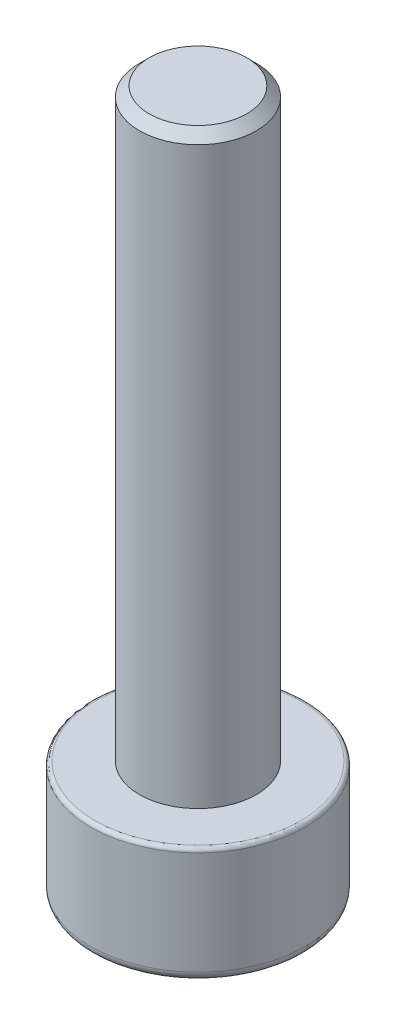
ISO-10303-21;
HEADER;
FILE_DESCRIPTION(('STEP AP214'),'2;1');
FILE_NAME('part.step','',(''),(''),'','','');
FILE_SCHEMA(('AUTOMOTIVE_DESIGN { 1 0 10303 214 1 1 1 1 }'));
ENDSEC;
DATA;
#1=APPLICATION_CONTEXT('core data for automotive mechanical design processes');
#2=APPLICATION_PROTOCOL_DEFINITION('international standard','automotive_design',2000,#1);
#3=PRODUCT_CONTEXT('',#1,'mechanical');
#4=PRODUCT('Part','Part','',(#3));
#5=PRODUCT_RELATED_PRODUCT_CATEGORY('part','',(#4));
#6=PRODUCT_DEFINITION_FORMATION('','',#4);
#7=PRODUCT_DEFINITION_CONTEXT('part definition',#1,'design');
#8=PRODUCT_DEFINITION('design','',#6,#7);
#9=PRODUCT_DEFINITION_SHAPE('','',#8);
#10=(LENGTH_UNIT() NAMED_UNIT(*) SI_UNIT(.MILLI.,.METRE.));
#11=(NAMED_UNIT(*) PLANE_ANGLE_UNIT() SI_UNIT($,.RADIAN.));
#12=(NAMED_UNIT(*) SI_UNIT($,.STERADIAN.) SOLID_ANGLE_UNIT());
#13=UNCERTAINTY_MEASURE_WITH_UNIT(LENGTH_MEASURE(1.E-05),#10,'distance_accuracy_value','');
#14=(GEOMETRIC_REPRESENTATION_CONTEXT(3) GLOBAL_UNCERTAINTY_ASSIGNED_CONTEXT((#13)) GLOBAL_UNIT_ASSIGNED_CONTEXT((#10,
#11,#12)) REPRESENTATION_CONTEXT('',''));
#15=CARTESIAN_POINT('',(0.,0.,0.));
#16=DIRECTION('',(0.,0.,1.));
#17=DIRECTION('',(1.,0.,0.));
#18=AXIS2_PLACEMENT_3D('',#15,#16,#17);
#19=CARTESIAN_POINT('',(0.,3.,0.));
#20=DIRECTION('',(0.,-1.,0.));
#21=DIRECTION('',(0.,0.,-1.));
#22=AXIS2_PLACEMENT_3D('',#19,#20,#21);
#23=CYLINDRICAL_SURFACE('',#22,2.75);
#24=CARTESIAN_POINT('',(0.,2.9,0.));
#25=DIRECTION('',(0.,1.,0.));
#26=DIRECTION('',(0.,0.,1.));
#27=AXIS2_PLACEMENT_3D('',#24,#25,#26);
#28=CIRCLE('',#27,2.75);
#29=CARTESIAN_POINT('',(0.,2.9,2.75));
#30=VERTEX_POINT('',#29);
#31=EDGE_CURVE('E11',#30,#30,#28,.F.);
#32=ORIENTED_EDGE('',*,*,#31,.T.);
#33=EDGE_LOOP('',(#32));
#34=FACE_BOUND('',#33,.T.);
#35=CARTESIAN_POINT('',(0.,0.25,0.));
#36=DIRECTION('',(0.,1.,0.));
#37=DIRECTION('',(0.,0.,1.));
#38=AXIS2_PLACEMENT_3D('',#35,#36,#37);
#39=CIRCLE('',#38,2.75);
#40=CARTESIAN_POINT('',(0.,0.25,2.75));
#41=VERTEX_POINT('',#40);
#42=EDGE_CURVE('E178',#41,#41,#39,.T.);
#43=ORIENTED_EDGE('',*,*,#42,.T.);
#44=EDGE_LOOP('',(#43));
#45=FACE_BOUND('',#44,.T.);
#46=ADVANCED_FACE('F34',(#34,#45),#23,.T.);
#47=CARTESIAN_POINT('',(0.,3.,0.));
#48=DIRECTION('',(0.,1.,0.));
#49=DIRECTION('',(0.,0.,1.));
#50=AXIS2_PLACEMENT_3D('',#47,#48,#49);
#51=PLANE('',#50);
#52=CARTESIAN_POINT('',(0.,3.,0.));
#53=DIRECTION('',(0.,1.,0.));
#54=DIRECTION('',(0.,0.,1.));
#55=AXIS2_PLACEMENT_3D('',#52,#53,#54);
#56=CIRCLE('',#55,2.65);
#57=CARTESIAN_POINT('',(0.,3.,2.65));
#58=VERTEX_POINT('',#57);
#59=EDGE_CURVE('E42',#58,#58,#56,.T.);
#60=ORIENTED_EDGE('',*,*,#59,.T.);
#61=EDGE_LOOP('',(#60));
#62=FACE_BOUND('',#61,.T.);
#63=CARTESIAN_POINT('',(0.,3.,0.));
#64=DIRECTION('',(0.,1.,0.));
#65=DIRECTION('',(0.,0.,1.));
#66=AXIS2_PLACEMENT_3D('',#63,#64,#65);
#67=CIRCLE('',#66,1.5);
#68=CARTESIAN_POINT('',(0.,3.,1.5));
#69=VERTEX_POINT('',#68);
#70=EDGE_CURVE('E142',#69,#69,#67,.T.);
#71=ORIENTED_EDGE('',*,*,#70,.F.);
#72=EDGE_LOOP('',(#71));
#73=FACE_BOUND('',#72,.T.);
#74=ADVANCED_FACE('F204',(#62,#73),#51,.T.);
#75=CARTESIAN_POINT('',(0.,0.,0.));
#76=DIRECTION('',(0.,1.,0.));
#77=DIRECTION('',(0.,0.,1.));
#78=AXIS2_PLACEMENT_3D('',#75,#76,#77);
#79=PLANE('',#78);
#80=CARTESIAN_POINT('',(0.,0.,0.));
#81=DIRECTION('',(0.,1.,0.));
#82=DIRECTION('',(0.,0.,1.));
#83=AXIS2_PLACEMENT_3D('',#80,#81,#82);
#84=CIRCLE('',#83,2.5);
#85=CARTESIAN_POINT('',(0.,0.,2.5));
#86=VERTEX_POINT('',#85);
#87=EDGE_CURVE('E193',#86,#86,#84,.F.);
#88=ORIENTED_EDGE('',*,*,#87,.T.);
#89=EDGE_LOOP('',(#88));
#90=FACE_BOUND('',#89,.T.);
#91=DIRECTION('',(-0.69197693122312,0.,-0.721919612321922));
#92=VECTOR('',#91,1.);
#93=CARTESIAN_POINT('',(1.02450088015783,0.,-0.982008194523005));
#94=LINE('',#93,#92);
#95=CARTESIAN_POINT('',(1.5914635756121,0.,-0.390512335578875));
#96=VERTEX_POINT('',#95);
#97=CARTESIAN_POINT('',(0.457538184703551,0.,-1.57350405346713));
#98=VERTEX_POINT('',#97);
#99=EDGE_CURVE('E157',#96,#98,#94,.T.);
#100=ORIENTED_EDGE('',*,*,#99,.T.);
#101=DIRECTION('',(-0.971189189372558,0.,0.238309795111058));
#102=VECTOR('',#101,1.);
#103=CARTESIAN_POINT('',(-0.338193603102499,0.,-1.3782478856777));
#104=LINE('',#103,#102);
#105=CARTESIAN_POINT('',(-1.13392539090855,0.,-1.18299171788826));
#106=VERTEX_POINT('',#105);
#107=EDGE_CURVE('E167',#98,#106,#104,.T.);
#108=ORIENTED_EDGE('',*,*,#107,.T.);
#109=DIRECTION('',(-0.279212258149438,0.,0.96022940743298));
#110=VECTOR('',#109,1.);
#111=CARTESIAN_POINT('',(-1.36269448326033,0.,-0.396239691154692));
#112=LINE('',#111,#110);
#113=CARTESIAN_POINT('',(-1.5914635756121,0.,0.390512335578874));
#114=VERTEX_POINT('',#113);
#115=EDGE_CURVE('E165',#106,#114,#112,.T.);
#116=ORIENTED_EDGE('',*,*,#115,.T.);
#117=DIRECTION('',(0.69197693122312,0.,0.721919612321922));
#118=VECTOR('',#117,1.);
#119=CARTESIAN_POINT('',(-1.02450088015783,0.,0.982008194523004));
#120=LINE('',#119,#118);
#121=CARTESIAN_POINT('',(-0.457538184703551,0.,1.57350405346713));
#122=VERTEX_POINT('',#121);
#123=EDGE_CURVE('E163',#114,#122,#120,.T.);
#124=ORIENTED_EDGE('',*,*,#123,.T.);
#125=DIRECTION('',(0.971189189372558,0.,-0.238309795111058));
#126=VECTOR('',#125,1.);
#127=CARTESIAN_POINT('',(0.338193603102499,0.,1.3782478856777));
#128=LINE('',#127,#126);
#129=CARTESIAN_POINT('',(1.13392539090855,0.,1.18299171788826));
#130=VERTEX_POINT('',#129);
#131=EDGE_CURVE('E161',#122,#130,#128,.T.);
#132=ORIENTED_EDGE('',*,*,#131,.T.);
#133=DIRECTION('',(0.279212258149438,0.,-0.96022940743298));
#134=VECTOR('',#133,1.);
#135=CARTESIAN_POINT('',(1.36269448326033,0.,0.396239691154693));
#136=LINE('',#135,#134);
#137=EDGE_CURVE('E159',#130,#96,#136,.T.);
#138=ORIENTED_EDGE('',*,*,#137,.T.);
#139=EDGE_LOOP('',(#100,#108,#116,#124,#132,#138));
#140=FACE_BOUND('',#139,.T.);
#141=ADVANCED_FACE('F222',(#90,#140),#79,.F.);
#142=CARTESIAN_POINT('',(0.,18.,0.));
#143=DIRECTION('',(0.,-1.,0.));
#144=DIRECTION('',(0.,0.,-1.));
#145=AXIS2_PLACEMENT_3D('',#142,#143,#144);
#146=CYLINDRICAL_SURFACE('',#145,1.5);
#147=CARTESIAN_POINT('',(0.,17.75,0.));
#148=DIRECTION('',(0.,1.,0.));
#149=DIRECTION('',(0.,0.,1.));
#150=AXIS2_PLACEMENT_3D('',#147,#148,#149);
#151=CIRCLE('',#150,1.5);
#152=CARTESIAN_POINT('',(0.,17.75,1.5));
#153=VERTEX_POINT('',#152);
#154=EDGE_CURVE('E199',#153,#153,#151,.F.);
#155=ORIENTED_EDGE('',*,*,#154,.T.);
#156=EDGE_LOOP('',(#155));
#157=FACE_BOUND('',#156,.T.);
#158=ORIENTED_EDGE('',*,*,#70,.T.);
#159=EDGE_LOOP('',(#158));
#160=FACE_BOUND('',#159,.T.);
#161=ADVANCED_FACE('F261',(#157,#160),#146,.T.);
#162=CARTESIAN_POINT('',(0.,18.,0.));
#163=DIRECTION('',(0.,1.,0.));
#164=DIRECTION('',(0.,0.,1.));
#165=AXIS2_PLACEMENT_3D('',#162,#163,#164);
#166=PLANE('',#165);
#167=CARTESIAN_POINT('',(0.,18.,0.));
#168=DIRECTION('',(0.,1.,0.));
#169=DIRECTION('',(0.,0.,1.));
#170=AXIS2_PLACEMENT_3D('',#167,#168,#169);
#171=CIRCLE('',#170,1.25);
#172=CARTESIAN_POINT('',(0.,18.,1.25));
#173=VERTEX_POINT('',#172);
#174=EDGE_CURVE('E196',#173,#173,#171,.T.);
#175=ORIENTED_EDGE('',*,*,#174,.T.);
#176=EDGE_LOOP('',(#175));
#177=FACE_BOUND('',#176,.T.);
#178=ADVANCED_FACE('F300',(#177),#166,.T.);
#179=CARTESIAN_POINT('',(1.31110540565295,1.5,-0.321718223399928));
#180=DIRECTION('',(0.96022940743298,0.,0.279212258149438));
#181=DIRECTION('',(0.279212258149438,0.,-0.96022940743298));
#182=AXIS2_PLACEMENT_3D('',#179,#180,#181);
#183=PLANE('',#182);
#184=DIRECTION('',(0.,-1.,0.));
#185=VECTOR('',#184,1.);
#186=CARTESIAN_POINT('',(1.31110540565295,1.5,-0.321718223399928));
#187=LINE('',#186,#185);
#188=CARTESIAN_POINT('',(1.31110540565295,1.5,-0.321718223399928));
#189=VERTEX_POINT('',#188);
#190=CARTESIAN_POINT('',(1.31110540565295,0.249999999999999,-0.321718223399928));
#191=VERTEX_POINT('',#190);
#192=EDGE_CURVE('E140',#189,#191,#187,.T.);
#193=ORIENTED_EDGE('',*,*,#192,.T.);
#194=DIRECTION('',(-0.279212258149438,0.,0.96022940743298));
#195=VECTOR('',#194,1.);
#196=CARTESIAN_POINT('',(1.31110540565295,0.249999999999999,-0.321718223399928));
#197=LINE('',#196,#195);
#198=CARTESIAN_POINT('',(0.934168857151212,0.249999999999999,0.974591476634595));
#199=VERTEX_POINT('',#198);
#200=EDGE_CURVE('E56',#191,#199,#197,.T.);
#201=ORIENTED_EDGE('',*,*,#200,.T.);
#202=DIRECTION('',(0.,-1.,0.));
#203=VECTOR('',#202,1.);
#204=CARTESIAN_POINT('',(0.934168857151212,1.5,0.974591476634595));
#205=LINE('',#204,#203);
#206=CARTESIAN_POINT('',(0.934168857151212,1.5,0.974591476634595));
#207=VERTEX_POINT('',#206);
#208=EDGE_CURVE('E104',#207,#199,#205,.T.);
#209=ORIENTED_EDGE('',*,*,#208,.F.);
#210=DIRECTION('',(-0.279212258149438,0.,0.96022940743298));
#211=VECTOR('',#210,1.);
#212=CARTESIAN_POINT('',(1.31110540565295,1.5,-0.321718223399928));
#213=LINE('',#212,#211);
#214=EDGE_CURVE('E108',#189,#207,#213,.T.);
#215=ORIENTED_EDGE('',*,*,#214,.F.);
#216=EDGE_LOOP('',(#193,#201,#209,#215));
#217=FACE_BOUND('',#216,.T.);
#218=ADVANCED_FACE('F106',(#217),#183,.F.);
#219=CARTESIAN_POINT('',(0.376936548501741,1.5,-1.29630970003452));
#220=DIRECTION('',(0.721919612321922,0.,-0.69197693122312));
#221=DIRECTION('',(-0.69197693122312,0.,-0.721919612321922));
#222=AXIS2_PLACEMENT_3D('',#219,#220,#221);
#223=PLANE('',#222);
#224=DIRECTION('',(0.,-1.,0.));
#225=VECTOR('',#224,1.);
#226=CARTESIAN_POINT('',(0.376936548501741,1.5,-1.29630970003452));
#227=LINE('',#226,#225);
#228=CARTESIAN_POINT('',(0.376936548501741,1.5,-1.29630970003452));
#229=VERTEX_POINT('',#228);
#230=CARTESIAN_POINT('',(0.376936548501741,0.249999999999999,-1.29630970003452));
#231=VERTEX_POINT('',#230);
#232=EDGE_CURVE('E143',#229,#231,#227,.T.);
#233=ORIENTED_EDGE('',*,*,#232,.T.);
#234=DIRECTION('',(0.69197693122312,0.,0.721919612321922));
#235=VECTOR('',#234,1.);
#236=CARTESIAN_POINT('',(0.376936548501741,0.249999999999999,-1.29630970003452));
#237=LINE('',#236,#235);
#238=EDGE_CURVE('E49',#231,#191,#237,.T.);
#239=ORIENTED_EDGE('',*,*,#238,.T.);
#240=ORIENTED_EDGE('',*,*,#192,.F.);
#241=DIRECTION('',(0.69197693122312,0.,0.721919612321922));
#242=VECTOR('',#241,1.);
#243=CARTESIAN_POINT('',(0.376936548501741,1.5,-1.29630970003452));
#244=LINE('',#243,#242);
#245=EDGE_CURVE('E113',#229,#189,#244,.T.);
#246=ORIENTED_EDGE('',*,*,#245,.F.);
#247=EDGE_LOOP('',(#233,#239,#240,#246));
#248=FACE_BOUND('',#247,.T.);
#249=ADVANCED_FACE('F273',(#248),#223,.F.);
#250=CARTESIAN_POINT('',(-0.934168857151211,1.5,-0.974591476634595));
#251=DIRECTION('',(-0.238309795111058,0.,-0.971189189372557));
#252=DIRECTION('',(-0.971189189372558,0.,0.238309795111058));
#253=AXIS2_PLACEMENT_3D('',#250,#251,#252);
#254=PLANE('',#253);
#255=DIRECTION('',(0.,-1.,0.));
#256=VECTOR('',#255,1.);
#257=CARTESIAN_POINT('',(-0.934168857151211,1.5,-0.974591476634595));
#258=LINE('',#257,#256);
#259=CARTESIAN_POINT('',(-0.934168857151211,1.5,-0.974591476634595));
#260=VERTEX_POINT('',#259);
#261=CARTESIAN_POINT('',(-0.934168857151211,0.249999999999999,-0.974591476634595));
#262=VERTEX_POINT('',#261);
#263=EDGE_CURVE('E145',#260,#262,#258,.T.);
#264=ORIENTED_EDGE('',*,*,#263,.T.);
#265=DIRECTION('',(0.971189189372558,0.,-0.238309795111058));
#266=VECTOR('',#265,1.);
#267=CARTESIAN_POINT('',(-0.934168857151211,0.249999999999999,-0.974591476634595));
#268=LINE('',#267,#266);
#269=EDGE_CURVE('E154',#262,#231,#268,.T.);
#270=ORIENTED_EDGE('',*,*,#269,.T.);
#271=ORIENTED_EDGE('',*,*,#232,.F.);
#272=DIRECTION('',(0.971189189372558,0.,-0.238309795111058));
#273=VECTOR('',#272,1.);
#274=CARTESIAN_POINT('',(-0.934168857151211,1.5,-0.974591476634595));
#275=LINE('',#274,#273);
#276=EDGE_CURVE('E137',#260,#229,#275,.T.);
#277=ORIENTED_EDGE('',*,*,#276,.F.);
#278=EDGE_LOOP('',(#264,#270,#271,#277));
#279=FACE_BOUND('',#278,.T.);
#280=ADVANCED_FACE('F271',(#279),#254,.F.);
#281=CARTESIAN_POINT('',(-1.31110540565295,1.5,0.321718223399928));
#282=DIRECTION('',(-0.96022940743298,0.,-0.279212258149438));
#283=DIRECTION('',(-0.279212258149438,0.,0.96022940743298));
#284=AXIS2_PLACEMENT_3D('',#281,#282,#283);
#285=PLANE('',#284);
#286=DIRECTION('',(0.,-1.,0.));
#287=VECTOR('',#286,1.);
#288=CARTESIAN_POINT('',(-1.31110540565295,1.5,0.321718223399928));
#289=LINE('',#288,#287);
#290=CARTESIAN_POINT('',(-1.31110540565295,1.5,0.321718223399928));
#291=VERTEX_POINT('',#290);
#292=CARTESIAN_POINT('',(-1.31110540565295,0.249999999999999,0.321718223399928));
#293=VERTEX_POINT('',#292);
#294=EDGE_CURVE('E148',#291,#293,#289,.T.);
#295=ORIENTED_EDGE('',*,*,#294,.T.);
#296=DIRECTION('',(0.279212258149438,0.,-0.96022940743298));
#297=VECTOR('',#296,1.);
#298=CARTESIAN_POINT('',(-1.31110540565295,0.249999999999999,0.321718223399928));
#299=LINE('',#298,#297);
#300=EDGE_CURVE('E170',#293,#262,#299,.T.);
#301=ORIENTED_EDGE('',*,*,#300,.T.);
#302=ORIENTED_EDGE('',*,*,#263,.F.);
#303=DIRECTION('',(0.279212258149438,0.,-0.96022940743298));
#304=VECTOR('',#303,1.);
#305=CARTESIAN_POINT('',(-1.31110540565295,1.5,0.321718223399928));
#306=LINE('',#305,#304);
#307=EDGE_CURVE('E134',#291,#260,#306,.T.);
#308=ORIENTED_EDGE('',*,*,#307,.F.);
#309=EDGE_LOOP('',(#295,#301,#302,#308));
#310=FACE_BOUND('',#309,.T.);
#311=ADVANCED_FACE('F282',(#310),#285,.F.);
#312=CARTESIAN_POINT('',(-0.376936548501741,1.5,1.29630970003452));
#313=DIRECTION('',(-0.721919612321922,0.,0.69197693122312));
#314=DIRECTION('',(0.69197693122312,0.,0.721919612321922));
#315=AXIS2_PLACEMENT_3D('',#312,#313,#314);
#316=PLANE('',#315);
#317=DIRECTION('',(0.,-1.,0.));
#318=VECTOR('',#317,1.);
#319=CARTESIAN_POINT('',(-0.376936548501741,1.5,1.29630970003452));
#320=LINE('',#319,#318);
#321=CARTESIAN_POINT('',(-0.376936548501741,1.5,1.29630970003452));
#322=VERTEX_POINT('',#321);
#323=CARTESIAN_POINT('',(-0.376936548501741,0.249999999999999,1.29630970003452));
#324=VERTEX_POINT('',#323);
#325=EDGE_CURVE('E112',#322,#324,#320,.T.);
#326=ORIENTED_EDGE('',*,*,#325,.T.);
#327=DIRECTION('',(-0.69197693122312,0.,-0.721919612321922));
#328=VECTOR('',#327,1.);
#329=CARTESIAN_POINT('',(-0.376936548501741,0.249999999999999,1.29630970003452));
#330=LINE('',#329,#328);
#331=EDGE_CURVE('E172',#324,#293,#330,.T.);
#332=ORIENTED_EDGE('',*,*,#331,.T.);
#333=ORIENTED_EDGE('',*,*,#294,.F.);
#334=DIRECTION('',(-0.69197693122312,0.,-0.721919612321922));
#335=VECTOR('',#334,1.);
#336=CARTESIAN_POINT('',(-0.376936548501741,1.5,1.29630970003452));
#337=LINE('',#336,#335);
#338=EDGE_CURVE('E122',#322,#291,#337,.T.);
#339=ORIENTED_EDGE('',*,*,#338,.F.);
#340=EDGE_LOOP('',(#326,#332,#333,#339));
#341=FACE_BOUND('',#340,.T.);
#342=ADVANCED_FACE('F279',(#341),#316,.F.);
#343=CARTESIAN_POINT('',(0.934168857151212,1.5,0.974591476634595));
#344=DIRECTION('',(0.238309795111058,0.,0.971189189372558));
#345=DIRECTION('',(0.971189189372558,0.,-0.238309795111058));
#346=AXIS2_PLACEMENT_3D('',#343,#344,#345);
#347=PLANE('',#346);
#348=ORIENTED_EDGE('',*,*,#208,.T.);
#349=DIRECTION('',(-0.971189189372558,0.,0.238309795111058));
#350=VECTOR('',#349,1.);
#351=CARTESIAN_POINT('',(0.934168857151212,0.249999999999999,0.974591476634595));
#352=LINE('',#351,#350);
#353=EDGE_CURVE('E174',#199,#324,#352,.T.);
#354=ORIENTED_EDGE('',*,*,#353,.T.);
#355=ORIENTED_EDGE('',*,*,#325,.F.);
#356=DIRECTION('',(-0.971189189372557,0.,0.238309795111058));
#357=VECTOR('',#356,1.);
#358=CARTESIAN_POINT('',(0.934168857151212,1.5,0.974591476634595));
#359=LINE('',#358,#357);
#360=EDGE_CURVE('E116',#207,#322,#359,.T.);
#361=ORIENTED_EDGE('',*,*,#360,.F.);
#362=EDGE_LOOP('',(#348,#354,#355,#361));
#363=FACE_BOUND('',#362,.T.);
#364=ADVANCED_FACE('F117',(#363),#347,.F.);
#365=CARTESIAN_POINT('',(0.,1.5,0.));
#366=DIRECTION('',(0.,-1.,0.));
#367=DIRECTION('',(0.,0.,-1.));
#368=AXIS2_PLACEMENT_3D('',#365,#366,#367);
#369=PLANE('',#368);
#370=ORIENTED_EDGE('',*,*,#214,.T.);
#371=ORIENTED_EDGE('',*,*,#360,.T.);
#372=ORIENTED_EDGE('',*,*,#338,.T.);
#373=ORIENTED_EDGE('',*,*,#307,.T.);
#374=ORIENTED_EDGE('',*,*,#276,.T.);
#375=ORIENTED_EDGE('',*,*,#245,.T.);
#376=EDGE_LOOP('',(#370,#371,#372,#373,#374,#375));
#377=FACE_BOUND('',#376,.T.);
#378=ADVANCED_FACE('F124',(#377),#369,.T.);
#379=CARTESIAN_POINT('',(0.934168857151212,0.249999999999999,0.974591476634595));
#380=DIRECTION('',(0.168510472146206,0.707106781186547,0.686734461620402));
#381=DIRECTION('',(-0.971189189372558,0.,0.238309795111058));
#382=AXIS2_PLACEMENT_3D('',#379,#380,#381);
#383=PLANE('',#382);
#384=DIRECTION('',(-0.523085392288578,0.654653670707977,-0.545719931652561));
#385=VECTOR('',#384,1.);
#386=CARTESIAN_POINT('',(0.934168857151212,0.249999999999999,0.974591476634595));
#387=LINE('',#386,#385);
#388=EDGE_CURVE('E130',#130,#199,#387,.T.);
#389=ORIENTED_EDGE('',*,*,#388,.F.);
#390=ORIENTED_EDGE('',*,*,#131,.F.);
#391=DIRECTION('',(0.211064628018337,0.654653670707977,-0.725865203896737));
#392=VECTOR('',#391,1.);
#393=CARTESIAN_POINT('',(-0.376936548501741,0.249999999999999,1.29630970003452));
#394=LINE('',#393,#392);
#395=EDGE_CURVE('E127',#324,#122,#394,.F.);
#396=ORIENTED_EDGE('',*,*,#395,.F.);
#397=ORIENTED_EDGE('',*,*,#353,.F.);
#398=EDGE_LOOP('',(#389,#390,#396,#397));
#399=FACE_BOUND('',#398,.T.);
#400=ADVANCED_FACE('F246',(#399),#383,.F.);
#401=CARTESIAN_POINT('',(-0.376936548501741,0.249999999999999,1.29630970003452));
#402=DIRECTION('',(-0.510474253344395,0.707106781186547,0.489301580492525));
#403=DIRECTION('',(-0.69197693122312,0.,-0.721919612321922));
#404=AXIS2_PLACEMENT_3D('',#401,#402,#403);
#405=PLANE('',#404);
#406=ORIENTED_EDGE('',*,*,#395,.T.);
#407=ORIENTED_EDGE('',*,*,#123,.F.);
#408=DIRECTION('',(0.734150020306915,0.654653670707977,-0.180145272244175));
#409=VECTOR('',#408,1.);
#410=CARTESIAN_POINT('',(-1.31110540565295,0.249999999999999,0.321718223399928));
#411=LINE('',#410,#409);
#412=EDGE_CURVE('E186',#293,#114,#411,.F.);
#413=ORIENTED_EDGE('',*,*,#412,.F.);
#414=ORIENTED_EDGE('',*,*,#331,.F.);
#415=EDGE_LOOP('',(#406,#407,#413,#414));
#416=FACE_BOUND('',#415,.T.);
#417=ADVANCED_FACE('F242',(#416),#405,.F.);
#418=CARTESIAN_POINT('',(1.31110540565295,0.249999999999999,-0.321718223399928));
#419=DIRECTION('',(0.6789847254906,0.707106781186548,0.197432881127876));
#420=DIRECTION('',(-0.279212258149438,0.,0.96022940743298));
#421=AXIS2_PLACEMENT_3D('',#418,#419,#420);
#422=PLANE('',#421);
#423=ORIENTED_EDGE('',*,*,#388,.T.);
#424=ORIENTED_EDGE('',*,*,#200,.F.);
#425=DIRECTION('',(-0.734150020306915,0.654653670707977,0.180145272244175));
#426=VECTOR('',#425,1.);
#427=CARTESIAN_POINT('',(1.31110540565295,0.249999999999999,-0.321718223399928));
#428=LINE('',#427,#426);
#429=EDGE_CURVE('E183',#96,#191,#428,.T.);
#430=ORIENTED_EDGE('',*,*,#429,.F.);
#431=ORIENTED_EDGE('',*,*,#137,.F.);
#432=EDGE_LOOP('',(#423,#424,#430,#431));
#433=FACE_BOUND('',#432,.T.);
#434=ADVANCED_FACE('F238',(#433),#422,.F.);
#435=CARTESIAN_POINT('',(-1.31110540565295,0.249999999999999,0.321718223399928));
#436=DIRECTION('',(-0.6789847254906,0.707106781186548,-0.197432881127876));
#437=DIRECTION('',(0.279212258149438,0.,-0.96022940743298));
#438=AXIS2_PLACEMENT_3D('',#435,#436,#437);
#439=PLANE('',#438);
#440=ORIENTED_EDGE('',*,*,#412,.T.);
#441=ORIENTED_EDGE('',*,*,#115,.F.);
#442=DIRECTION('',(0.523085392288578,0.654653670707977,0.545719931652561));
#443=VECTOR('',#442,1.);
#444=CARTESIAN_POINT('',(-0.934168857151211,0.249999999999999,-0.974591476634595));
#445=LINE('',#444,#443);
#446=EDGE_CURVE('E181',#262,#106,#445,.F.);
#447=ORIENTED_EDGE('',*,*,#446,.F.);
#448=ORIENTED_EDGE('',*,*,#300,.F.);
#449=EDGE_LOOP('',(#440,#441,#447,#448));
#450=FACE_BOUND('',#449,.T.);
#451=ADVANCED_FACE('F234',(#450),#439,.F.);
#452=CARTESIAN_POINT('',(0.376936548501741,0.249999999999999,-1.29630970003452));
#453=DIRECTION('',(0.510474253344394,0.707106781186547,-0.489301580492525));
#454=DIRECTION('',(0.69197693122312,0.,0.721919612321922));
#455=AXIS2_PLACEMENT_3D('',#452,#453,#454);
#456=PLANE('',#455);
#457=ORIENTED_EDGE('',*,*,#429,.T.);
#458=ORIENTED_EDGE('',*,*,#238,.F.);
#459=DIRECTION('',(0.211064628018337,-0.654653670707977,-0.725865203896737));
#460=VECTOR('',#459,1.);
#461=CARTESIAN_POINT('',(0.269240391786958,0.584038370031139,-0.92593550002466));
#462=LINE('',#461,#460);
#463=EDGE_CURVE('E179',#98,#231,#462,.F.);
#464=ORIENTED_EDGE('',*,*,#463,.F.);
#465=ORIENTED_EDGE('',*,*,#99,.F.);
#466=EDGE_LOOP('',(#457,#458,#464,#465));
#467=FACE_BOUND('',#466,.T.);
#468=ADVANCED_FACE('F230',(#467),#456,.F.);
#469=CARTESIAN_POINT('',(-0.934168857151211,0.249999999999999,-0.974591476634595));
#470=DIRECTION('',(-0.168510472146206,0.707106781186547,-0.686734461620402));
#471=DIRECTION('',(0.971189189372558,0.,-0.238309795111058));
#472=AXIS2_PLACEMENT_3D('',#469,#470,#471);
#473=PLANE('',#472);
#474=ORIENTED_EDGE('',*,*,#446,.T.);
#475=ORIENTED_EDGE('',*,*,#107,.F.);
#476=ORIENTED_EDGE('',*,*,#463,.T.);
#477=ORIENTED_EDGE('',*,*,#269,.F.);
#478=EDGE_LOOP('',(#474,#475,#476,#477));
#479=FACE_BOUND('',#478,.T.);
#480=ADVANCED_FACE('F227',(#479),#473,.F.);
#481=CARTESIAN_POINT('',(0.,0.25,0.));
#482=DIRECTION('',(0.,1.,0.));
#483=DIRECTION('',(0.,0.,1.));
#484=AXIS2_PLACEMENT_3D('',#481,#482,#483);
#485=TOROIDAL_SURFACE('',#484,2.5,0.25);
#486=ORIENTED_EDGE('',*,*,#87,.F.);
#487=EDGE_LOOP('',(#486));
#488=FACE_BOUND('',#487,.T.);
#489=ORIENTED_EDGE('',*,*,#42,.F.);
#490=EDGE_LOOP('',(#489));
#491=FACE_BOUND('',#490,.T.);
#492=ADVANCED_FACE('F213',(#488,#491),#485,.T.);
#493=CARTESIAN_POINT('',(0.,18.,0.));
#494=DIRECTION('',(0.,-1.,0.));
#495=DIRECTION('',(0.,0.,-1.));
#496=AXIS2_PLACEMENT_3D('',#493,#494,#495);
#497=CONICAL_SURFACE('',#496,1.25,0.785398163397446);
#498=ORIENTED_EDGE('',*,*,#154,.F.);
#499=EDGE_LOOP('',(#498));
#500=FACE_BOUND('',#499,.T.);
#501=ORIENTED_EDGE('',*,*,#174,.F.);
#502=EDGE_LOOP('',(#501));
#503=FACE_BOUND('',#502,.T.);
#504=ADVANCED_FACE('F208',(#500,#503),#497,.T.);
#505=CARTESIAN_POINT('',(0.,2.9,0.));
#506=DIRECTION('',(0.,1.,0.));
#507=DIRECTION('',(0.,0.,1.));
#508=AXIS2_PLACEMENT_3D('',#505,#506,#507);
#509=TOROIDAL_SURFACE('',#508,2.65,0.1);
#510=ORIENTED_EDGE('',*,*,#31,.F.);
#511=EDGE_LOOP('',(#510));
#512=FACE_BOUND('',#511,.T.);
#513=ORIENTED_EDGE('',*,*,#59,.F.);
#514=EDGE_LOOP('',(#513));
#515=FACE_BOUND('',#514,.T.);
#516=ADVANCED_FACE('F36',(#512,#515),#509,.T.);
#517=CLOSED_SHELL('',(#46,#74,#141,#161,#178,#218,#249,#280,#311,#342,#364,#378,#400,#417,#434,
#451,#468,#480,#492,#504,#516));
#518=MANIFOLD_SOLID_BREP('B2',#517);
#519=ADVANCED_BREP_SHAPE_REPRESENTATION('',(#18,#518),#14);
#520=SHAPE_DEFINITION_REPRESENTATION(#9,#519);
ENDSEC;
END-ISO-10303-21;
